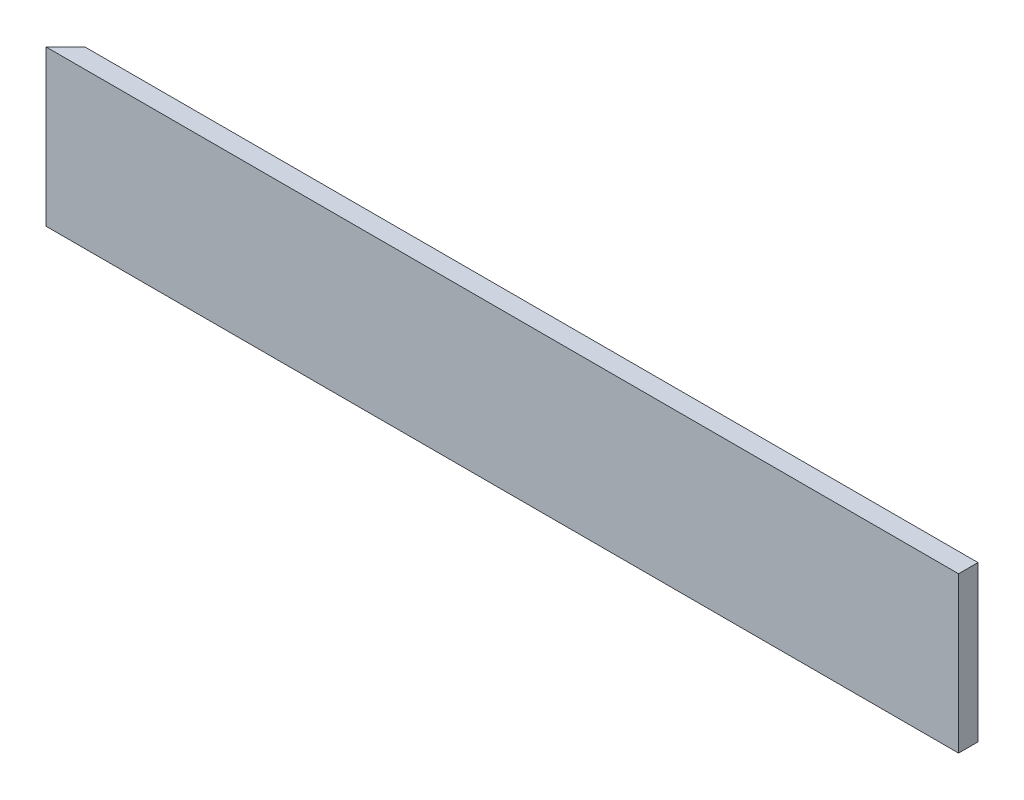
ISO-10303-21;
HEADER;
FILE_DESCRIPTION(('STEP AP214'),'2;1');
FILE_NAME('part.step','',(''),(''),'','','');
FILE_SCHEMA(('AUTOMOTIVE_DESIGN { 1 0 10303 214 1 1 1 1 }'));
ENDSEC;
DATA;
#1=APPLICATION_CONTEXT('core data for automotive mechanical design processes');
#2=APPLICATION_PROTOCOL_DEFINITION('international standard','automotive_design',2000,#1);
#3=PRODUCT_CONTEXT('',#1,'mechanical');
#4=PRODUCT('Part','Part','',(#3));
#5=PRODUCT_RELATED_PRODUCT_CATEGORY('part','',(#4));
#6=PRODUCT_DEFINITION_FORMATION('','',#4);
#7=PRODUCT_DEFINITION_CONTEXT('part definition',#1,'design');
#8=PRODUCT_DEFINITION('design','',#6,#7);
#9=PRODUCT_DEFINITION_SHAPE('','',#8);
#10=(LENGTH_UNIT() NAMED_UNIT(*) SI_UNIT(.MILLI.,.METRE.));
#11=(NAMED_UNIT(*) PLANE_ANGLE_UNIT() SI_UNIT($,.RADIAN.));
#12=(NAMED_UNIT(*) SI_UNIT($,.STERADIAN.) SOLID_ANGLE_UNIT());
#13=UNCERTAINTY_MEASURE_WITH_UNIT(LENGTH_MEASURE(1.E-05),#10,'distance_accuracy_value','');
#14=(GEOMETRIC_REPRESENTATION_CONTEXT(3) GLOBAL_UNCERTAINTY_ASSIGNED_CONTEXT((#13)) GLOBAL_UNIT_ASSIGNED_CONTEXT((#10,
#11,#12)) REPRESENTATION_CONTEXT('',''));
#15=CARTESIAN_POINT('',(0.,0.,0.));
#16=DIRECTION('',(0.,0.,1.));
#17=DIRECTION('',(1.,0.,0.));
#18=AXIS2_PLACEMENT_3D('',#15,#16,#17);
#19=CARTESIAN_POINT('',(-1168.4,203.2,0.));
#20=DIRECTION('',(0.,0.,1.));
#21=DIRECTION('',(1.,0.,0.));
#22=AXIS2_PLACEMENT_3D('',#19,#20,#21);
#23=PLANE('',#22);
#24=DIRECTION('',(-1.,0.,0.));
#25=VECTOR('',#24,1.);
#26=CARTESIAN_POINT('',(-1168.4,0.,0.));
#27=LINE('',#26,#25);
#28=CARTESIAN_POINT('',(0.,0.,0.));
#29=VERTEX_POINT('',#28);
#30=CARTESIAN_POINT('',(-1168.4,0.,0.));
#31=VERTEX_POINT('',#30);
#32=EDGE_CURVE('E102',#29,#31,#27,.T.);
#33=ORIENTED_EDGE('',*,*,#32,.T.);
#34=DIRECTION('',(0.,-1.,0.));
#35=VECTOR('',#34,1.);
#36=CARTESIAN_POINT('',(-1168.4,203.2,0.));
#37=LINE('',#36,#35);
#38=CARTESIAN_POINT('',(-1168.4,203.2,0.));
#39=VERTEX_POINT('',#38);
#40=EDGE_CURVE('E11',#39,#31,#37,.T.);
#41=ORIENTED_EDGE('',*,*,#40,.F.);
#42=DIRECTION('',(-1.,0.,0.));
#43=VECTOR('',#42,1.);
#44=CARTESIAN_POINT('',(-1168.4,203.2,0.));
#45=LINE('',#44,#43);
#46=CARTESIAN_POINT('',(0.,203.2,0.));
#47=VERTEX_POINT('',#46);
#48=EDGE_CURVE('E90',#47,#39,#45,.T.);
#49=ORIENTED_EDGE('',*,*,#48,.F.);
#50=DIRECTION('',(0.,-1.,0.));
#51=VECTOR('',#50,1.);
#52=CARTESIAN_POINT('',(0.,203.2,0.));
#53=LINE('',#52,#51);
#54=EDGE_CURVE('E98',#47,#29,#53,.T.);
#55=ORIENTED_EDGE('',*,*,#54,.T.);
#56=EDGE_LOOP('',(#33,#41,#49,#55));
#57=FACE_BOUND('',#56,.T.);
#58=ADVANCED_FACE('F39',(#57),#23,.F.);
#59=CARTESIAN_POINT('',(-1193.8,203.2,25.4000000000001));
#60=DIRECTION('',(0.707106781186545,0.,0.70710678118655));
#61=DIRECTION('',(0.70710678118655,0.,-0.707106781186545));
#62=AXIS2_PLACEMENT_3D('',#59,#60,#61);
#63=PLANE('',#62);
#64=DIRECTION('',(-0.70710678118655,0.,0.707106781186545));
#65=VECTOR('',#64,1.);
#66=CARTESIAN_POINT('',(-1193.8,0.,25.4000000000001));
#67=LINE('',#66,#65);
#68=CARTESIAN_POINT('',(-1193.8,0.,25.4000000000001));
#69=VERTEX_POINT('',#68);
#70=EDGE_CURVE('E94',#31,#69,#67,.T.);
#71=ORIENTED_EDGE('',*,*,#70,.T.);
#72=DIRECTION('',(0.,-1.,0.));
#73=VECTOR('',#72,1.);
#74=CARTESIAN_POINT('',(-1193.8,203.2,25.4000000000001));
#75=LINE('',#74,#73);
#76=CARTESIAN_POINT('',(-1193.8,203.2,25.4000000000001));
#77=VERTEX_POINT('',#76);
#78=EDGE_CURVE('E47',#77,#69,#75,.T.);
#79=ORIENTED_EDGE('',*,*,#78,.F.);
#80=DIRECTION('',(-0.70710678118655,0.,0.707106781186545));
#81=VECTOR('',#80,1.);
#82=CARTESIAN_POINT('',(-1193.8,203.2,25.4000000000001));
#83=LINE('',#82,#81);
#84=EDGE_CURVE('E85',#39,#77,#83,.T.);
#85=ORIENTED_EDGE('',*,*,#84,.F.);
#86=ORIENTED_EDGE('',*,*,#40,.T.);
#87=EDGE_LOOP('',(#71,#79,#85,#86));
#88=FACE_BOUND('',#87,.T.);
#89=ADVANCED_FACE('F93',(#88),#63,.F.);
#90=CARTESIAN_POINT('',(0.,203.2,25.4));
#91=DIRECTION('',(0.,0.,-1.));
#92=DIRECTION('',(-1.,0.,0.));
#93=AXIS2_PLACEMENT_3D('',#90,#91,#92);
#94=PLANE('',#93);
#95=DIRECTION('',(1.,0.,0.));
#96=VECTOR('',#95,1.);
#97=CARTESIAN_POINT('',(0.,0.,25.4));
#98=LINE('',#97,#96);
#99=CARTESIAN_POINT('',(0.,0.,25.4));
#100=VERTEX_POINT('',#99);
#101=EDGE_CURVE('E72',#69,#100,#98,.T.);
#102=ORIENTED_EDGE('',*,*,#101,.T.);
#103=DIRECTION('',(0.,-1.,0.));
#104=VECTOR('',#103,1.);
#105=CARTESIAN_POINT('',(0.,203.2,25.4));
#106=LINE('',#105,#104);
#107=CARTESIAN_POINT('',(0.,203.2,25.4));
#108=VERTEX_POINT('',#107);
#109=EDGE_CURVE('E95',#108,#100,#106,.T.);
#110=ORIENTED_EDGE('',*,*,#109,.F.);
#111=DIRECTION('',(1.,0.,0.));
#112=VECTOR('',#111,1.);
#113=CARTESIAN_POINT('',(0.,203.2,25.4));
#114=LINE('',#113,#112);
#115=EDGE_CURVE('E88',#77,#108,#114,.T.);
#116=ORIENTED_EDGE('',*,*,#115,.F.);
#117=ORIENTED_EDGE('',*,*,#78,.T.);
#118=EDGE_LOOP('',(#102,#110,#116,#117));
#119=FACE_BOUND('',#118,.T.);
#120=ADVANCED_FACE('F96',(#119),#94,.F.);
#121=CARTESIAN_POINT('',(0.,203.2,0.));
#122=DIRECTION('',(-1.,0.,0.));
#123=DIRECTION('',(0.,0.,1.));
#124=AXIS2_PLACEMENT_3D('',#121,#122,#123);
#125=PLANE('',#124);
#126=DIRECTION('',(0.,0.,-1.));
#127=VECTOR('',#126,1.);
#128=CARTESIAN_POINT('',(0.,0.,0.));
#129=LINE('',#128,#127);
#130=EDGE_CURVE('E78',#100,#29,#129,.T.);
#131=ORIENTED_EDGE('',*,*,#130,.T.);
#132=ORIENTED_EDGE('',*,*,#54,.F.);
#133=DIRECTION('',(0.,0.,-1.));
#134=VECTOR('',#133,1.);
#135=CARTESIAN_POINT('',(0.,203.2,0.));
#136=LINE('',#135,#134);
#137=EDGE_CURVE('E55',#108,#47,#136,.T.);
#138=ORIENTED_EDGE('',*,*,#137,.F.);
#139=ORIENTED_EDGE('',*,*,#109,.T.);
#140=EDGE_LOOP('',(#131,#132,#138,#139));
#141=FACE_BOUND('',#140,.T.);
#142=ADVANCED_FACE('F109',(#141),#125,.F.);
#143=CARTESIAN_POINT('',(0.,203.2,0.));
#144=DIRECTION('',(0.,-1.,0.));
#145=DIRECTION('',(0.,0.,-1.));
#146=AXIS2_PLACEMENT_3D('',#143,#144,#145);
#147=PLANE('',#146);
#148=ORIENTED_EDGE('',*,*,#48,.T.);
#149=ORIENTED_EDGE('',*,*,#84,.T.);
#150=ORIENTED_EDGE('',*,*,#115,.T.);
#151=ORIENTED_EDGE('',*,*,#137,.T.);
#152=EDGE_LOOP('',(#148,#149,#150,#151));
#153=FACE_BOUND('',#152,.T.);
#154=ADVANCED_FACE('F86',(#153),#147,.F.);
#155=CARTESIAN_POINT('',(0.,0.,0.));
#156=DIRECTION('',(0.,-1.,0.));
#157=DIRECTION('',(0.,0.,-1.));
#158=AXIS2_PLACEMENT_3D('',#155,#156,#157);
#159=PLANE('',#158);
#160=ORIENTED_EDGE('',*,*,#32,.F.);
#161=ORIENTED_EDGE('',*,*,#130,.F.);
#162=ORIENTED_EDGE('',*,*,#101,.F.);
#163=ORIENTED_EDGE('',*,*,#70,.F.);
#164=EDGE_LOOP('',(#160,#161,#162,#163));
#165=FACE_BOUND('',#164,.T.);
#166=ADVANCED_FACE('F112',(#165),#159,.T.);
#167=CLOSED_SHELL('',(#58,#89,#120,#142,#154,#166));
#168=MANIFOLD_SOLID_BREP('B2',#167);
#169=ADVANCED_BREP_SHAPE_REPRESENTATION('',(#18,#168),#14);
#170=SHAPE_DEFINITION_REPRESENTATION(#9,#169);
ENDSEC;
END-ISO-10303-21;
